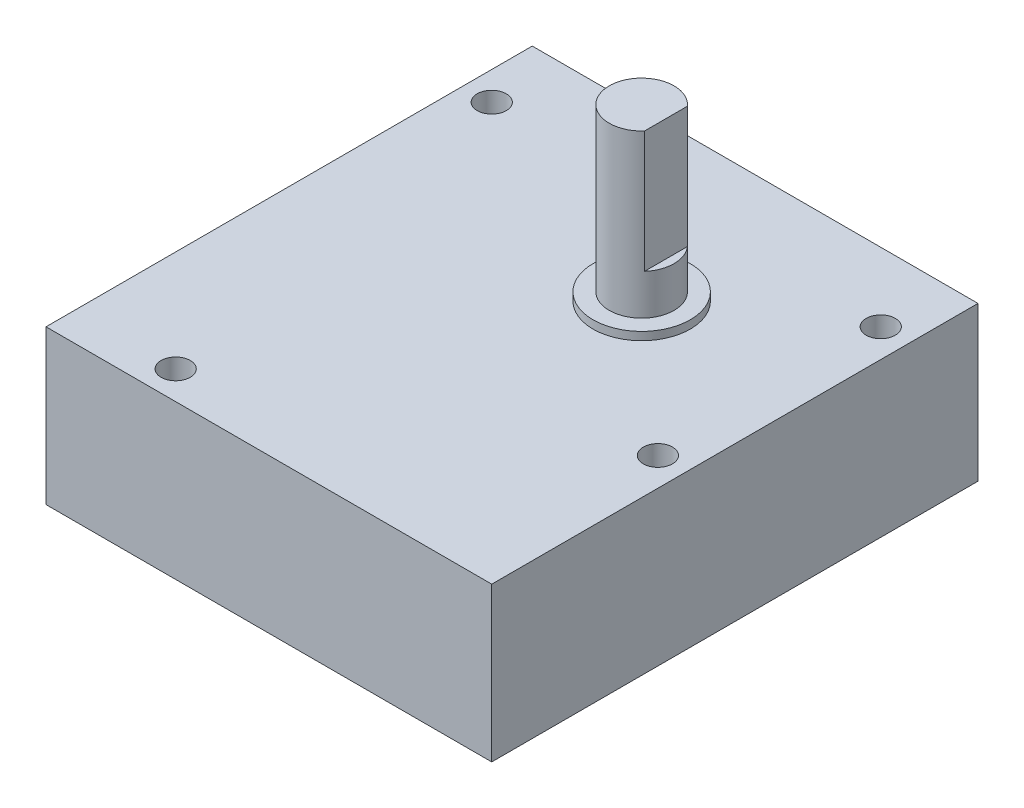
ISO-10303-21;
HEADER;
FILE_DESCRIPTION(('STEP AP214'),'2;1');
FILE_NAME('part.step','',(''),(''),'','','');
FILE_SCHEMA(('AUTOMOTIVE_DESIGN { 1 0 10303 214 1 1 1 1 }'));
ENDSEC;
DATA;
#1=APPLICATION_CONTEXT('core data for automotive mechanical design processes');
#2=APPLICATION_PROTOCOL_DEFINITION('international standard','automotive_design',2000,#1);
#3=PRODUCT_CONTEXT('',#1,'mechanical');
#4=PRODUCT('Part','Part','',(#3));
#5=PRODUCT_RELATED_PRODUCT_CATEGORY('part','',(#4));
#6=PRODUCT_DEFINITION_FORMATION('','',#4);
#7=PRODUCT_DEFINITION_CONTEXT('part definition',#1,'design');
#8=PRODUCT_DEFINITION('design','',#6,#7);
#9=PRODUCT_DEFINITION_SHAPE('','',#8);
#10=(LENGTH_UNIT() NAMED_UNIT(*) SI_UNIT(.MILLI.,.METRE.));
#11=(NAMED_UNIT(*) PLANE_ANGLE_UNIT() SI_UNIT($,.RADIAN.));
#12=(NAMED_UNIT(*) SI_UNIT($,.STERADIAN.) SOLID_ANGLE_UNIT());
#13=UNCERTAINTY_MEASURE_WITH_UNIT(LENGTH_MEASURE(1.E-05),#10,'distance_accuracy_value','');
#14=(GEOMETRIC_REPRESENTATION_CONTEXT(3) GLOBAL_UNCERTAINTY_ASSIGNED_CONTEXT((#13)) GLOBAL_UNIT_ASSIGNED_CONTEXT((#10,
#11,#12)) REPRESENTATION_CONTEXT('',''));
#15=CARTESIAN_POINT('',(0.,0.,0.));
#16=DIRECTION('',(0.,0.,1.));
#17=DIRECTION('',(1.,0.,0.));
#18=AXIS2_PLACEMENT_3D('',#15,#16,#17);
#19=CARTESIAN_POINT('',(27.5,19.,-30.));
#20=DIRECTION('',(-1.,0.,0.));
#21=DIRECTION('',(0.,0.,1.));
#22=AXIS2_PLACEMENT_3D('',#19,#20,#21);
#23=PLANE('',#22);
#24=DIRECTION('',(0.,0.,-1.));
#25=VECTOR('',#24,1.);
#26=CARTESIAN_POINT('',(27.5,0.,-30.));
#27=LINE('',#26,#25);
#28=CARTESIAN_POINT('',(27.5,0.,30.));
#29=VERTEX_POINT('',#28);
#30=CARTESIAN_POINT('',(27.5,0.,-30.));
#31=VERTEX_POINT('',#30);
#32=EDGE_CURVE('E144',#29,#31,#27,.T.);
#33=ORIENTED_EDGE('',*,*,#32,.T.);
#34=DIRECTION('',(0.,-1.,0.));
#35=VECTOR('',#34,1.);
#36=CARTESIAN_POINT('',(27.5,19.,-30.));
#37=LINE('',#36,#35);
#38=CARTESIAN_POINT('',(27.5,19.,-30.));
#39=VERTEX_POINT('',#38);
#40=EDGE_CURVE('E11',#39,#31,#37,.T.);
#41=ORIENTED_EDGE('',*,*,#40,.F.);
#42=DIRECTION('',(0.,0.,-1.));
#43=VECTOR('',#42,1.);
#44=CARTESIAN_POINT('',(27.5,19.,-30.));
#45=LINE('',#44,#43);
#46=CARTESIAN_POINT('',(27.5,19.,30.));
#47=VERTEX_POINT('',#46);
#48=EDGE_CURVE('E145',#47,#39,#45,.T.);
#49=ORIENTED_EDGE('',*,*,#48,.F.);
#50=DIRECTION('',(0.,-1.,0.));
#51=VECTOR('',#50,1.);
#52=CARTESIAN_POINT('',(27.5,19.,30.));
#53=LINE('',#52,#51);
#54=EDGE_CURVE('E151',#47,#29,#53,.T.);
#55=ORIENTED_EDGE('',*,*,#54,.T.);
#56=EDGE_LOOP('',(#33,#41,#49,#55));
#57=FACE_BOUND('',#56,.T.);
#58=ADVANCED_FACE('F38',(#57),#23,.F.);
#59=CARTESIAN_POINT('',(-27.5,19.,-30.));
#60=DIRECTION('',(0.,0.,1.));
#61=DIRECTION('',(1.,0.,0.));
#62=AXIS2_PLACEMENT_3D('',#59,#60,#61);
#63=PLANE('',#62);
#64=DIRECTION('',(-1.,0.,0.));
#65=VECTOR('',#64,1.);
#66=CARTESIAN_POINT('',(-27.5,0.,-30.));
#67=LINE('',#66,#65);
#68=CARTESIAN_POINT('',(-27.5,0.,-30.));
#69=VERTEX_POINT('',#68);
#70=EDGE_CURVE('E154',#31,#69,#67,.T.);
#71=ORIENTED_EDGE('',*,*,#70,.T.);
#72=DIRECTION('',(0.,-1.,0.));
#73=VECTOR('',#72,1.);
#74=CARTESIAN_POINT('',(-27.5,19.,-30.));
#75=LINE('',#74,#73);
#76=CARTESIAN_POINT('',(-27.5,19.,-30.));
#77=VERTEX_POINT('',#76);
#78=EDGE_CURVE('E46',#77,#69,#75,.T.);
#79=ORIENTED_EDGE('',*,*,#78,.F.);
#80=DIRECTION('',(-1.,0.,0.));
#81=VECTOR('',#80,1.);
#82=CARTESIAN_POINT('',(-27.5,19.,-30.));
#83=LINE('',#82,#81);
#84=EDGE_CURVE('E90',#39,#77,#83,.T.);
#85=ORIENTED_EDGE('',*,*,#84,.F.);
#86=ORIENTED_EDGE('',*,*,#40,.T.);
#87=EDGE_LOOP('',(#71,#79,#85,#86));
#88=FACE_BOUND('',#87,.T.);
#89=ADVANCED_FACE('F185',(#88),#63,.F.);
#90=CARTESIAN_POINT('',(-27.5,19.,-30.));
#91=DIRECTION('',(1.,0.,0.));
#92=DIRECTION('',(0.,0.,-1.));
#93=AXIS2_PLACEMENT_3D('',#90,#91,#92);
#94=PLANE('',#93);
#95=DIRECTION('',(0.,0.,1.));
#96=VECTOR('',#95,1.);
#97=CARTESIAN_POINT('',(-27.5,0.,-30.));
#98=LINE('',#97,#96);
#99=CARTESIAN_POINT('',(-27.5,0.,30.));
#100=VERTEX_POINT('',#99);
#101=EDGE_CURVE('E156',#69,#100,#98,.T.);
#102=ORIENTED_EDGE('',*,*,#101,.T.);
#103=DIRECTION('',(0.,-1.,0.));
#104=VECTOR('',#103,1.);
#105=CARTESIAN_POINT('',(-27.5,19.,30.));
#106=LINE('',#105,#104);
#107=CARTESIAN_POINT('',(-27.5,19.,30.));
#108=VERTEX_POINT('',#107);
#109=EDGE_CURVE('E160',#108,#100,#106,.T.);
#110=ORIENTED_EDGE('',*,*,#109,.F.);
#111=DIRECTION('',(0.,0.,1.));
#112=VECTOR('',#111,1.);
#113=CARTESIAN_POINT('',(-27.5,19.,-30.));
#114=LINE('',#113,#112);
#115=EDGE_CURVE('E148',#77,#108,#114,.T.);
#116=ORIENTED_EDGE('',*,*,#115,.F.);
#117=ORIENTED_EDGE('',*,*,#78,.T.);
#118=EDGE_LOOP('',(#102,#110,#116,#117));
#119=FACE_BOUND('',#118,.T.);
#120=ADVANCED_FACE('F166',(#119),#94,.F.);
#121=CARTESIAN_POINT('',(-27.5,19.,30.));
#122=DIRECTION('',(0.,0.,-1.));
#123=DIRECTION('',(-1.,0.,0.));
#124=AXIS2_PLACEMENT_3D('',#121,#122,#123);
#125=PLANE('',#124);
#126=DIRECTION('',(1.,0.,0.));
#127=VECTOR('',#126,1.);
#128=CARTESIAN_POINT('',(-27.5,0.,30.));
#129=LINE('',#128,#127);
#130=EDGE_CURVE('E83',#100,#29,#129,.T.);
#131=ORIENTED_EDGE('',*,*,#130,.T.);
#132=ORIENTED_EDGE('',*,*,#54,.F.);
#133=DIRECTION('',(1.,0.,0.));
#134=VECTOR('',#133,1.);
#135=CARTESIAN_POINT('',(-27.5,19.,30.));
#136=LINE('',#135,#134);
#137=EDGE_CURVE('E62',#108,#47,#136,.T.);
#138=ORIENTED_EDGE('',*,*,#137,.F.);
#139=ORIENTED_EDGE('',*,*,#109,.T.);
#140=EDGE_LOOP('',(#131,#132,#138,#139));
#141=FACE_BOUND('',#140,.T.);
#142=ADVANCED_FACE('F174',(#141),#125,.F.);
#143=CARTESIAN_POINT('',(0.,19.,0.));
#144=DIRECTION('',(0.,1.,0.));
#145=DIRECTION('',(0.,0.,1.));
#146=AXIS2_PLACEMENT_3D('',#143,#144,#145);
#147=PLANE('',#146);
#148=CARTESIAN_POINT('',(6.50000000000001,19.,-9.49999999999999));
#149=DIRECTION('',(0.,1.,0.));
#150=DIRECTION('',(0.,0.,1.));
#151=AXIS2_PLACEMENT_3D('',#148,#149,#150);
#152=CIRCLE('',#151,6.);
#153=CARTESIAN_POINT('',(6.50000000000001,19.,-3.49999999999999));
#154=VERTEX_POINT('',#153);
#155=EDGE_CURVE('E321',#154,#154,#152,.T.);
#156=ORIENTED_EDGE('',*,*,#155,.F.);
#157=EDGE_LOOP('',(#156));
#158=FACE_BOUND('',#157,.T.);
#159=CARTESIAN_POINT('',(-15.,19.,26.5));
#160=DIRECTION('',(0.,1.,0.));
#161=DIRECTION('',(0.,0.,1.));
#162=AXIS2_PLACEMENT_3D('',#159,#160,#161);
#163=CIRCLE('',#162,1.8);
#164=CARTESIAN_POINT('',(-15.,19.,28.3));
#165=VERTEX_POINT('',#164);
#166=EDGE_CURVE('E141',#165,#165,#163,.T.);
#167=ORIENTED_EDGE('',*,*,#166,.F.);
#168=EDGE_LOOP('',(#167));
#169=FACE_BOUND('',#168,.T.);
#170=CARTESIAN_POINT('',(-24.,19.,-21.5));
#171=DIRECTION('',(0.,1.,0.));
#172=DIRECTION('',(0.,0.,1.));
#173=AXIS2_PLACEMENT_3D('',#170,#171,#172);
#174=CIRCLE('',#173,1.8);
#175=CARTESIAN_POINT('',(-24.,19.,-19.7));
#176=VERTEX_POINT('',#175);
#177=EDGE_CURVE('E138',#176,#176,#174,.T.);
#178=ORIENTED_EDGE('',*,*,#177,.F.);
#179=EDGE_LOOP('',(#178));
#180=FACE_BOUND('',#179,.T.);
#181=CARTESIAN_POINT('',(24.,19.,-21.5));
#182=DIRECTION('',(0.,1.,0.));
#183=DIRECTION('',(0.,0.,1.));
#184=AXIS2_PLACEMENT_3D('',#181,#182,#183);
#185=CIRCLE('',#184,1.8);
#186=CARTESIAN_POINT('',(24.,19.,-19.7));
#187=VERTEX_POINT('',#186);
#188=EDGE_CURVE('E135',#187,#187,#185,.T.);
#189=ORIENTED_EDGE('',*,*,#188,.F.);
#190=EDGE_LOOP('',(#189));
#191=FACE_BOUND('',#190,.T.);
#192=CARTESIAN_POINT('',(24.,19.,6.00000000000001));
#193=DIRECTION('',(0.,1.,0.));
#194=DIRECTION('',(0.,0.,1.));
#195=AXIS2_PLACEMENT_3D('',#192,#193,#194);
#196=CIRCLE('',#195,1.8);
#197=CARTESIAN_POINT('',(24.,19.,7.80000000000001));
#198=VERTEX_POINT('',#197);
#199=EDGE_CURVE('E124',#198,#198,#196,.T.);
#200=ORIENTED_EDGE('',*,*,#199,.F.);
#201=EDGE_LOOP('',(#200));
#202=FACE_BOUND('',#201,.T.);
#203=ORIENTED_EDGE('',*,*,#48,.T.);
#204=ORIENTED_EDGE('',*,*,#84,.T.);
#205=ORIENTED_EDGE('',*,*,#115,.T.);
#206=ORIENTED_EDGE('',*,*,#137,.T.);
#207=EDGE_LOOP('',(#203,#204,#205,#206));
#208=FACE_BOUND('',#207,.T.);
#209=ADVANCED_FACE('F176',(#158,#169,#180,#191,#202,#208),#147,.T.);
#210=CARTESIAN_POINT('',(0.,0.,0.));
#211=DIRECTION('',(0.,1.,0.));
#212=DIRECTION('',(0.,0.,1.));
#213=AXIS2_PLACEMENT_3D('',#210,#211,#212);
#214=PLANE('',#213);
#215=CARTESIAN_POINT('',(-15.,0.,26.5));
#216=DIRECTION('',(0.,1.,0.));
#217=DIRECTION('',(0.,0.,1.));
#218=AXIS2_PLACEMENT_3D('',#215,#216,#217);
#219=CIRCLE('',#218,1.8);
#220=CARTESIAN_POINT('',(-15.,0.,28.3));
#221=VERTEX_POINT('',#220);
#222=EDGE_CURVE('E121',#221,#221,#219,.T.);
#223=ORIENTED_EDGE('',*,*,#222,.T.);
#224=EDGE_LOOP('',(#223));
#225=FACE_BOUND('',#224,.T.);
#226=CARTESIAN_POINT('',(-24.,0.,-21.5));
#227=DIRECTION('',(0.,1.,0.));
#228=DIRECTION('',(0.,0.,1.));
#229=AXIS2_PLACEMENT_3D('',#226,#227,#228);
#230=CIRCLE('',#229,1.8);
#231=CARTESIAN_POINT('',(-24.,0.,-19.7));
#232=VERTEX_POINT('',#231);
#233=EDGE_CURVE('E125',#232,#232,#230,.T.);
#234=ORIENTED_EDGE('',*,*,#233,.T.);
#235=EDGE_LOOP('',(#234));
#236=FACE_BOUND('',#235,.T.);
#237=CARTESIAN_POINT('',(24.,0.,-21.5));
#238=DIRECTION('',(0.,1.,0.));
#239=DIRECTION('',(0.,0.,1.));
#240=AXIS2_PLACEMENT_3D('',#237,#238,#239);
#241=CIRCLE('',#240,1.8);
#242=CARTESIAN_POINT('',(24.,0.,-19.7));
#243=VERTEX_POINT('',#242);
#244=EDGE_CURVE('E128',#243,#243,#241,.T.);
#245=ORIENTED_EDGE('',*,*,#244,.T.);
#246=EDGE_LOOP('',(#245));
#247=FACE_BOUND('',#246,.T.);
#248=CARTESIAN_POINT('',(24.,0.,6.00000000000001));
#249=DIRECTION('',(0.,1.,0.));
#250=DIRECTION('',(0.,0.,1.));
#251=AXIS2_PLACEMENT_3D('',#248,#249,#250);
#252=CIRCLE('',#251,1.8);
#253=CARTESIAN_POINT('',(24.,0.,7.80000000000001));
#254=VERTEX_POINT('',#253);
#255=EDGE_CURVE('E120',#254,#254,#252,.T.);
#256=ORIENTED_EDGE('',*,*,#255,.T.);
#257=EDGE_LOOP('',(#256));
#258=FACE_BOUND('',#257,.T.);
#259=ORIENTED_EDGE('',*,*,#32,.F.);
#260=ORIENTED_EDGE('',*,*,#130,.F.);
#261=ORIENTED_EDGE('',*,*,#101,.F.);
#262=ORIENTED_EDGE('',*,*,#70,.F.);
#263=EDGE_LOOP('',(#259,#260,#261,#262));
#264=FACE_BOUND('',#263,.T.);
#265=ADVANCED_FACE('F170',(#225,#236,#247,#258,#264),#214,.F.);
#266=CARTESIAN_POINT('',(24.,0.,6.00000000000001));
#267=DIRECTION('',(0.,1.,0.));
#268=DIRECTION('',(0.,0.,1.));
#269=AXIS2_PLACEMENT_3D('',#266,#267,#268);
#270=CYLINDRICAL_SURFACE('',#269,1.8);
#271=ORIENTED_EDGE('',*,*,#199,.T.);
#272=EDGE_LOOP('',(#271));
#273=FACE_BOUND('',#272,.T.);
#274=ORIENTED_EDGE('',*,*,#255,.F.);
#275=EDGE_LOOP('',(#274));
#276=FACE_BOUND('',#275,.T.);
#277=ADVANCED_FACE('F220',(#273,#276),#270,.F.);
#278=CARTESIAN_POINT('',(24.,0.,-21.5));
#279=DIRECTION('',(0.,1.,0.));
#280=DIRECTION('',(0.,0.,1.));
#281=AXIS2_PLACEMENT_3D('',#278,#279,#280);
#282=CYLINDRICAL_SURFACE('',#281,1.8);
#283=ORIENTED_EDGE('',*,*,#188,.T.);
#284=EDGE_LOOP('',(#283));
#285=FACE_BOUND('',#284,.T.);
#286=ORIENTED_EDGE('',*,*,#244,.F.);
#287=EDGE_LOOP('',(#286));
#288=FACE_BOUND('',#287,.T.);
#289=ADVANCED_FACE('F229',(#285,#288),#282,.F.);
#290=CARTESIAN_POINT('',(-24.,0.,-21.5));
#291=DIRECTION('',(0.,1.,0.));
#292=DIRECTION('',(0.,0.,1.));
#293=AXIS2_PLACEMENT_3D('',#290,#291,#292);
#294=CYLINDRICAL_SURFACE('',#293,1.8);
#295=ORIENTED_EDGE('',*,*,#177,.T.);
#296=EDGE_LOOP('',(#295));
#297=FACE_BOUND('',#296,.T.);
#298=ORIENTED_EDGE('',*,*,#233,.F.);
#299=EDGE_LOOP('',(#298));
#300=FACE_BOUND('',#299,.T.);
#301=ADVANCED_FACE('F239',(#297,#300),#294,.F.);
#302=CARTESIAN_POINT('',(-15.,0.,26.5));
#303=DIRECTION('',(0.,1.,0.));
#304=DIRECTION('',(0.,0.,1.));
#305=AXIS2_PLACEMENT_3D('',#302,#303,#304);
#306=CYLINDRICAL_SURFACE('',#305,1.8);
#307=ORIENTED_EDGE('',*,*,#166,.T.);
#308=EDGE_LOOP('',(#307));
#309=FACE_BOUND('',#308,.T.);
#310=ORIENTED_EDGE('',*,*,#222,.F.);
#311=EDGE_LOOP('',(#310));
#312=FACE_BOUND('',#311,.T.);
#313=ADVANCED_FACE('F249',(#309,#312),#306,.F.);
#314=CARTESIAN_POINT('',(6.50000000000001,20.,-9.49999999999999));
#315=DIRECTION('',(0.,-1.,0.));
#316=DIRECTION('',(0.,0.,-1.));
#317=AXIS2_PLACEMENT_3D('',#314,#315,#316);
#318=CYLINDRICAL_SURFACE('',#317,6.);
#319=CARTESIAN_POINT('',(6.50000000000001,20.,-9.49999999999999));
#320=DIRECTION('',(0.,1.,0.));
#321=DIRECTION('',(0.,0.,1.));
#322=AXIS2_PLACEMENT_3D('',#319,#320,#321);
#323=CIRCLE('',#322,6.);
#324=CARTESIAN_POINT('',(6.50000000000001,20.,-3.49999999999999));
#325=VERTEX_POINT('',#324);
#326=EDGE_CURVE('E320',#325,#325,#323,.T.);
#327=ORIENTED_EDGE('',*,*,#326,.F.);
#328=EDGE_LOOP('',(#327));
#329=FACE_BOUND('',#328,.T.);
#330=ORIENTED_EDGE('',*,*,#155,.T.);
#331=EDGE_LOOP('',(#330));
#332=FACE_BOUND('',#331,.T.);
#333=ADVANCED_FACE('F259',(#329,#332),#318,.T.);
#334=CARTESIAN_POINT('',(6.50000000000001,20.,-9.49999999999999));
#335=DIRECTION('',(0.,1.,0.));
#336=DIRECTION('',(0.,0.,1.));
#337=AXIS2_PLACEMENT_3D('',#334,#335,#336);
#338=PLANE('',#337);
#339=CARTESIAN_POINT('',(6.50000000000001,20.,-9.49999999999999));
#340=DIRECTION('',(0.,1.,0.));
#341=DIRECTION('',(0.,0.,1.));
#342=AXIS2_PLACEMENT_3D('',#339,#340,#341);
#343=CIRCLE('',#342,4.);
#344=CARTESIAN_POINT('',(6.50000000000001,20.,-5.49999999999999));
#345=VERTEX_POINT('',#344);
#346=EDGE_CURVE('E41',#345,#345,#343,.T.);
#347=ORIENTED_EDGE('',*,*,#346,.F.);
#348=EDGE_LOOP('',(#347));
#349=FACE_BOUND('',#348,.T.);
#350=ORIENTED_EDGE('',*,*,#326,.T.);
#351=EDGE_LOOP('',(#350));
#352=FACE_BOUND('',#351,.T.);
#353=ADVANCED_FACE('F296',(#349,#352),#338,.T.);
#354=CARTESIAN_POINT('',(6.50000000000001,25.,-9.49999999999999));
#355=DIRECTION('',(0.,1.,0.));
#356=DIRECTION('',(0.,0.,1.));
#357=AXIS2_PLACEMENT_3D('',#354,#355,#356);
#358=PLANE('',#357);
#359=CARTESIAN_POINT('',(6.50000000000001,25.,-9.49999999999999));
#360=DIRECTION('',(0.,1.,0.));
#361=DIRECTION('',(0.,0.,1.));
#362=AXIS2_PLACEMENT_3D('',#359,#360,#361);
#363=CIRCLE('',#362,4.);
#364=CARTESIAN_POINT('',(9.50000000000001,25.,-6.8542486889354));
#365=VERTEX_POINT('',#364);
#366=CARTESIAN_POINT('',(9.50000000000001,25.,-12.1457513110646));
#367=VERTEX_POINT('',#366);
#368=EDGE_CURVE('E101',#365,#367,#363,.T.);
#369=ORIENTED_EDGE('',*,*,#368,.T.);
#370=DIRECTION('',(0.,0.,1.));
#371=VECTOR('',#370,1.);
#372=CARTESIAN_POINT('',(9.50000000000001,25.,-12.1457513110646));
#373=LINE('',#372,#371);
#374=EDGE_CURVE('E103',#367,#365,#373,.T.);
#375=ORIENTED_EDGE('',*,*,#374,.T.);
#376=EDGE_LOOP('',(#369,#375));
#377=FACE_BOUND('',#376,.T.);
#378=ADVANCED_FACE('F102',(#377),#358,.T.);
#379=CARTESIAN_POINT('',(9.50000000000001,25.,-12.1457513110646));
#380=DIRECTION('',(-1.,0.,0.));
#381=DIRECTION('',(0.,0.,1.));
#382=AXIS2_PLACEMENT_3D('',#379,#380,#381);
#383=PLANE('',#382);
#384=DIRECTION('',(0.,0.,1.));
#385=VECTOR('',#384,1.);
#386=CARTESIAN_POINT('',(9.50000000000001,40.,-12.1457513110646));
#387=LINE('',#386,#385);
#388=CARTESIAN_POINT('',(9.50000000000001,40.,-12.1457513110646));
#389=VERTEX_POINT('',#388);
#390=CARTESIAN_POINT('',(9.50000000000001,40.,-6.8542486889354));
#391=VERTEX_POINT('',#390);
#392=EDGE_CURVE('E106',#389,#391,#387,.T.);
#393=ORIENTED_EDGE('',*,*,#392,.T.);
#394=DIRECTION('',(0.,1.,0.));
#395=VECTOR('',#394,1.);
#396=CARTESIAN_POINT('',(9.50000000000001,25.,-6.8542486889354));
#397=LINE('',#396,#395);
#398=EDGE_CURVE('E109',#365,#391,#397,.T.);
#399=ORIENTED_EDGE('',*,*,#398,.F.);
#400=ORIENTED_EDGE('',*,*,#374,.F.);
#401=DIRECTION('',(0.,1.,0.));
#402=VECTOR('',#401,1.);
#403=CARTESIAN_POINT('',(9.50000000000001,25.,-12.1457513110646));
#404=LINE('',#403,#402);
#405=EDGE_CURVE('E53',#367,#389,#404,.T.);
#406=ORIENTED_EDGE('',*,*,#405,.T.);
#407=EDGE_LOOP('',(#393,#399,#400,#406));
#408=FACE_BOUND('',#407,.T.);
#409=ADVANCED_FACE('F108',(#408),#383,.F.);
#410=CARTESIAN_POINT('',(6.50000000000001,40.,-9.49999999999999));
#411=DIRECTION('',(0.,1.,0.));
#412=DIRECTION('',(0.,0.,1.));
#413=AXIS2_PLACEMENT_3D('',#410,#411,#412);
#414=PLANE('',#413);
#415=ORIENTED_EDGE('',*,*,#392,.F.);
#416=CARTESIAN_POINT('',(6.50000000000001,40.,-9.49999999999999));
#417=DIRECTION('',(0.,1.,0.));
#418=DIRECTION('',(0.,0.,1.));
#419=AXIS2_PLACEMENT_3D('',#416,#417,#418);
#420=CIRCLE('',#419,4.);
#421=EDGE_CURVE('E114',#389,#391,#420,.T.);
#422=ORIENTED_EDGE('',*,*,#421,.T.);
#423=EDGE_LOOP('',(#415,#422));
#424=FACE_BOUND('',#423,.T.);
#425=ADVANCED_FACE('F270',(#424),#414,.T.);
#426=CARTESIAN_POINT('',(6.50000000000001,40.,-9.49999999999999));
#427=DIRECTION('',(0.,-1.,0.));
#428=DIRECTION('',(0.,0.,-1.));
#429=AXIS2_PLACEMENT_3D('',#426,#427,#428);
#430=CYLINDRICAL_SURFACE('',#429,4.);
#431=ORIENTED_EDGE('',*,*,#346,.T.);
#432=EDGE_LOOP('',(#431));
#433=FACE_BOUND('',#432,.T.);
#434=ORIENTED_EDGE('',*,*,#421,.F.);
#435=ORIENTED_EDGE('',*,*,#405,.F.);
#436=ORIENTED_EDGE('',*,*,#368,.F.);
#437=ORIENTED_EDGE('',*,*,#398,.T.);
#438=EDGE_LOOP('',(#434,#435,#436,#437));
#439=FACE_BOUND('',#438,.T.);
#440=ADVANCED_FACE('F112',(#433,#439),#430,.T.);
#441=CLOSED_SHELL('',(#58,#89,#120,#142,#209,#265,#277,#289,#301,#313,#333,#353,#378,#409,#425,#440));
#442=MANIFOLD_SOLID_BREP('B2',#441);
#443=ADVANCED_BREP_SHAPE_REPRESENTATION('',(#18,#442),#14);
#444=SHAPE_DEFINITION_REPRESENTATION(#9,#443);
ENDSEC;
END-ISO-10303-21;
